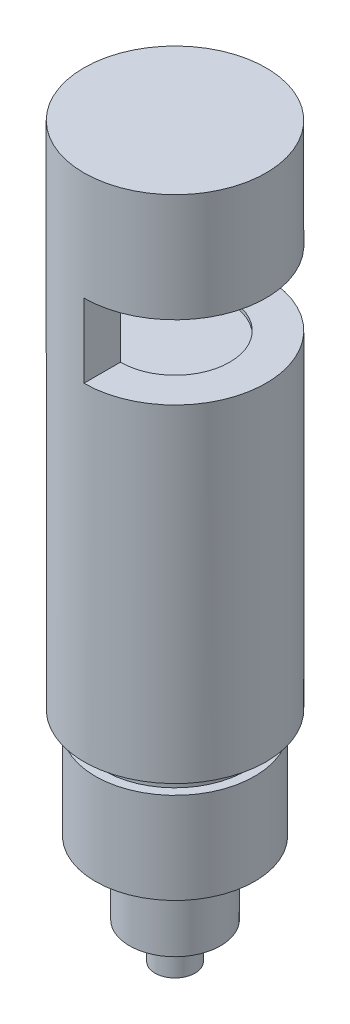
ISO-10303-21;
HEADER;
FILE_DESCRIPTION(('STEP AP214'),'2;1');
FILE_NAME('part.step','',(''),(''),'','','');
FILE_SCHEMA(('AUTOMOTIVE_DESIGN { 1 0 10303 214 1 1 1 1 }'));
ENDSEC;
DATA;
#1=APPLICATION_CONTEXT('core data for automotive mechanical design processes');
#2=APPLICATION_PROTOCOL_DEFINITION('international standard','automotive_design',2000,#1);
#3=PRODUCT_CONTEXT('',#1,'mechanical');
#4=PRODUCT('Part','Part','',(#3));
#5=PRODUCT_RELATED_PRODUCT_CATEGORY('part','',(#4));
#6=PRODUCT_DEFINITION_FORMATION('','',#4);
#7=PRODUCT_DEFINITION_CONTEXT('part definition',#1,'design');
#8=PRODUCT_DEFINITION('design','',#6,#7);
#9=PRODUCT_DEFINITION_SHAPE('','',#8);
#10=(LENGTH_UNIT() NAMED_UNIT(*) SI_UNIT(.MILLI.,.METRE.));
#11=(NAMED_UNIT(*) PLANE_ANGLE_UNIT() SI_UNIT($,.RADIAN.));
#12=(NAMED_UNIT(*) SI_UNIT($,.STERADIAN.) SOLID_ANGLE_UNIT());
#13=UNCERTAINTY_MEASURE_WITH_UNIT(LENGTH_MEASURE(1.E-05),#10,'distance_accuracy_value','');
#14=(GEOMETRIC_REPRESENTATION_CONTEXT(3) GLOBAL_UNCERTAINTY_ASSIGNED_CONTEXT((#13)) GLOBAL_UNIT_ASSIGNED_CONTEXT((#10,
#11,#12)) REPRESENTATION_CONTEXT('',''));
#15=CARTESIAN_POINT('',(0.,0.,0.));
#16=DIRECTION('',(0.,0.,1.));
#17=DIRECTION('',(1.,0.,0.));
#18=AXIS2_PLACEMENT_3D('',#15,#16,#17);
#19=CARTESIAN_POINT('',(0.,-12.7,0.));
#20=DIRECTION('',(0.,-1.,0.));
#21=DIRECTION('',(0.,0.,-1.));
#22=AXIS2_PLACEMENT_3D('',#19,#20,#21);
#23=PLANE('',#22);
#24=CARTESIAN_POINT('',(0.,-12.7,0.));
#25=DIRECTION('',(0.,-1.,0.));
#26=DIRECTION('',(0.,0.,-1.));
#27=AXIS2_PLACEMENT_3D('',#24,#25,#26);
#28=CIRCLE('',#27,3.175);
#29=CARTESIAN_POINT('',(0.,-12.7,-3.175));
#30=VERTEX_POINT('',#29);
#31=EDGE_CURVE('E124',#30,#30,#28,.T.);
#32=ORIENTED_EDGE('',*,*,#31,.T.);
#33=EDGE_LOOP('',(#32));
#34=FACE_BOUND('',#33,.T.);
#35=CARTESIAN_POINT('',(0.,-12.7,0.));
#36=DIRECTION('',(0.,-1.,0.));
#37=DIRECTION('',(1.,0.,0.));
#38=AXIS2_PLACEMENT_3D('',#35,#36,#37);
#39=CIRCLE('',#38,1.397);
#40=CARTESIAN_POINT('',(1.397,-12.7,0.));
#41=VERTEX_POINT('',#40);
#42=EDGE_CURVE('E143',#41,#41,#39,.T.);
#43=ORIENTED_EDGE('',*,*,#42,.F.);
#44=EDGE_LOOP('',(#43));
#45=FACE_BOUND('',#44,.T.);
#46=ADVANCED_FACE('F37',(#34,#45),#23,.T.);
#47=CARTESIAN_POINT('',(0.,28.0035,-17.78));
#48=DIRECTION('',(-1.,0.,0.));
#49=DIRECTION('',(0.,-1.,0.));
#50=AXIS2_PLACEMENT_3D('',#47,#48,#49);
#51=PLANE('',#50);
#52=DIRECTION('',(0.,-1.,0.));
#53=VECTOR('',#52,1.);
#54=CARTESIAN_POINT('',(0.,39.287807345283,-3.81));
#55=LINE('',#54,#53);
#56=CARTESIAN_POINT('',(0.,22.86,-3.81));
#57=VERTEX_POINT('',#56);
#58=CARTESIAN_POINT('',(0.,28.0035,-3.81));
#59=VERTEX_POINT('',#58);
#60=EDGE_CURVE('E77',#57,#59,#55,.F.);
#61=ORIENTED_EDGE('',*,*,#60,.F.);
#62=DIRECTION('',(0.,0.,1.));
#63=VECTOR('',#62,1.);
#64=CARTESIAN_POINT('',(0.,22.86,-17.78));
#65=LINE('',#64,#63);
#66=CARTESIAN_POINT('',(0.,22.86,-6.35));
#67=VERTEX_POINT('',#66);
#68=EDGE_CURVE('E86',#67,#57,#65,.T.);
#69=ORIENTED_EDGE('',*,*,#68,.F.);
#70=DIRECTION('',(0.,-1.,0.));
#71=VECTOR('',#70,1.);
#72=CARTESIAN_POINT('',(0.,35.56,-6.35));
#73=LINE('',#72,#71);
#74=CARTESIAN_POINT('',(0.,28.0035,-6.35));
#75=VERTEX_POINT('',#74);
#76=EDGE_CURVE('E107',#75,#67,#73,.T.);
#77=ORIENTED_EDGE('',*,*,#76,.F.);
#78=DIRECTION('',(0.,0.,1.));
#79=VECTOR('',#78,1.);
#80=CARTESIAN_POINT('',(0.,28.0035,-17.78));
#81=LINE('',#80,#79);
#82=EDGE_CURVE('E89',#75,#59,#81,.T.);
#83=ORIENTED_EDGE('',*,*,#82,.T.);
#84=EDGE_LOOP('',(#61,#69,#77,#83));
#85=FACE_BOUND('',#84,.T.);
#86=ADVANCED_FACE('F85',(#85),#51,.F.);
#87=DIRECTION('',(0.,-1.,0.));
#88=VECTOR('',#87,1.);
#89=CARTESIAN_POINT('',(0.,39.287807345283,3.81));
#90=LINE('',#89,#88);
#91=CARTESIAN_POINT('',(0.,28.0035,3.81));
#92=VERTEX_POINT('',#91);
#93=CARTESIAN_POINT('',(0.,22.86,3.81));
#94=VERTEX_POINT('',#93);
#95=EDGE_CURVE('E51',#92,#94,#90,.T.);
#96=ORIENTED_EDGE('',*,*,#95,.F.);
#97=CARTESIAN_POINT('',(0.,28.0035,6.35));
#98=VERTEX_POINT('',#97);
#99=EDGE_CURVE('E58',#92,#98,#81,.T.);
#100=ORIENTED_EDGE('',*,*,#99,.T.);
#101=DIRECTION('',(0.,-1.,0.));
#102=VECTOR('',#101,1.);
#103=CARTESIAN_POINT('',(0.,35.56,6.35));
#104=LINE('',#103,#102);
#105=CARTESIAN_POINT('',(0.,22.86,6.35));
#106=VERTEX_POINT('',#105);
#107=EDGE_CURVE('E104',#106,#98,#104,.F.);
#108=ORIENTED_EDGE('',*,*,#107,.F.);
#109=EDGE_CURVE('E95',#94,#106,#65,.T.);
#110=ORIENTED_EDGE('',*,*,#109,.F.);
#111=EDGE_LOOP('',(#96,#100,#108,#110));
#112=FACE_BOUND('',#111,.T.);
#113=ADVANCED_FACE('F164',(#112),#51,.F.);
#114=CARTESIAN_POINT('',(6.35,28.0035,-17.78));
#115=DIRECTION('',(0.,1.,0.));
#116=DIRECTION('',(0.,0.,1.));
#117=AXIS2_PLACEMENT_3D('',#114,#115,#116);
#118=PLANE('',#117);
#119=CARTESIAN_POINT('',(0.,28.0035,0.));
#120=DIRECTION('',(0.,1.,0.));
#121=DIRECTION('',(0.,0.,1.));
#122=AXIS2_PLACEMENT_3D('',#119,#120,#121);
#123=CIRCLE('',#122,3.81);
#124=EDGE_CURVE('E90',#59,#92,#123,.F.);
#125=ORIENTED_EDGE('',*,*,#124,.F.);
#126=ORIENTED_EDGE('',*,*,#82,.F.);
#127=CARTESIAN_POINT('',(0.,28.0035,0.));
#128=DIRECTION('',(0.,1.,0.));
#129=DIRECTION('',(0.,0.,1.));
#130=AXIS2_PLACEMENT_3D('',#127,#128,#129);
#131=CIRCLE('',#130,6.35);
#132=EDGE_CURVE('E45',#98,#75,#131,.T.);
#133=ORIENTED_EDGE('',*,*,#132,.F.);
#134=ORIENTED_EDGE('',*,*,#99,.F.);
#135=EDGE_LOOP('',(#125,#126,#133,#134));
#136=FACE_BOUND('',#135,.T.);
#137=ADVANCED_FACE('F112',(#136),#118,.F.);
#138=CARTESIAN_POINT('',(6.35,22.86,-17.78));
#139=DIRECTION('',(0.,-1.,0.));
#140=DIRECTION('',(1.,0.,0.));
#141=AXIS2_PLACEMENT_3D('',#138,#139,#140);
#142=PLANE('',#141);
#143=CARTESIAN_POINT('',(0.,22.86,0.));
#144=DIRECTION('',(0.,-1.,0.));
#145=DIRECTION('',(1.,0.,0.));
#146=AXIS2_PLACEMENT_3D('',#143,#144,#145);
#147=CIRCLE('',#146,3.81);
#148=EDGE_CURVE('E12',#94,#57,#147,.F.);
#149=ORIENTED_EDGE('',*,*,#148,.F.);
#150=ORIENTED_EDGE('',*,*,#109,.T.);
#151=CARTESIAN_POINT('',(0.,22.86,0.));
#152=DIRECTION('',(0.,-1.,0.));
#153=DIRECTION('',(1.,0.,0.));
#154=AXIS2_PLACEMENT_3D('',#151,#152,#153);
#155=CIRCLE('',#154,6.35);
#156=EDGE_CURVE('E94',#67,#106,#155,.T.);
#157=ORIENTED_EDGE('',*,*,#156,.F.);
#158=ORIENTED_EDGE('',*,*,#68,.T.);
#159=EDGE_LOOP('',(#149,#150,#157,#158));
#160=FACE_BOUND('',#159,.T.);
#161=ADVANCED_FACE('F92',(#160),#142,.F.);
#162=CARTESIAN_POINT('',(0.,35.56,0.));
#163=DIRECTION('',(0.,-1.,0.));
#164=DIRECTION('',(0.,0.,-1.));
#165=AXIS2_PLACEMENT_3D('',#162,#163,#164);
#166=CYLINDRICAL_SURFACE('',#165,6.35);
#167=ORIENTED_EDGE('',*,*,#107,.T.);
#168=ORIENTED_EDGE('',*,*,#132,.T.);
#169=ORIENTED_EDGE('',*,*,#76,.T.);
#170=ORIENTED_EDGE('',*,*,#156,.T.);
#171=EDGE_LOOP('',(#167,#168,#169,#170));
#172=FACE_BOUND('',#171,.T.);
#173=CARTESIAN_POINT('',(0.,35.56,0.));
#174=DIRECTION('',(0.,1.,0.));
#175=DIRECTION('',(0.,0.,1.));
#176=AXIS2_PLACEMENT_3D('',#173,#174,#175);
#177=CIRCLE('',#176,6.35);
#178=CARTESIAN_POINT('',(0.,35.56,6.35));
#179=VERTEX_POINT('',#178);
#180=EDGE_CURVE('E100',#179,#179,#177,.T.);
#181=ORIENTED_EDGE('',*,*,#180,.F.);
#182=EDGE_LOOP('',(#181));
#183=FACE_BOUND('',#182,.T.);
#184=CARTESIAN_POINT('',(0.,0.,0.));
#185=DIRECTION('',(0.,1.,0.));
#186=DIRECTION('',(-1.,0.,0.));
#187=AXIS2_PLACEMENT_3D('',#184,#185,#186);
#188=CIRCLE('',#187,6.35000000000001);
#189=CARTESIAN_POINT('',(-6.35000000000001,0.,0.));
#190=VERTEX_POINT('',#189);
#191=EDGE_CURVE('E128',#190,#190,#188,.T.);
#192=ORIENTED_EDGE('',*,*,#191,.T.);
#193=EDGE_LOOP('',(#192));
#194=FACE_BOUND('',#193,.T.);
#195=ADVANCED_FACE('F39',(#172,#183,#194),#166,.T.);
#196=CARTESIAN_POINT('',(0.,35.56,0.));
#197=DIRECTION('',(0.,1.,0.));
#198=DIRECTION('',(0.,0.,1.));
#199=AXIS2_PLACEMENT_3D('',#196,#197,#198);
#200=PLANE('',#199);
#201=ORIENTED_EDGE('',*,*,#180,.T.);
#202=EDGE_LOOP('',(#201));
#203=FACE_BOUND('',#202,.T.);
#204=ADVANCED_FACE('F189',(#203),#200,.T.);
#205=CARTESIAN_POINT('',(0.,39.287807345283,0.));
#206=DIRECTION('',(0.,-1.,0.));
#207=DIRECTION('',(1.,0.,0.));
#208=AXIS2_PLACEMENT_3D('',#205,#206,#207);
#209=CYLINDRICAL_SURFACE('',#208,3.81);
#210=CARTESIAN_POINT('',(0.,22.606,0.));
#211=DIRECTION('',(0.,1.,0.));
#212=DIRECTION('',(-1.,0.,0.));
#213=AXIS2_PLACEMENT_3D('',#210,#211,#212);
#214=CIRCLE('',#213,3.81);
#215=CARTESIAN_POINT('',(-3.81000000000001,22.606,0.));
#216=VERTEX_POINT('',#215);
#217=EDGE_CURVE('E118',#216,#216,#214,.T.);
#218=ORIENTED_EDGE('',*,*,#217,.F.);
#219=EDGE_LOOP('',(#218));
#220=FACE_BOUND('',#219,.T.);
#221=CARTESIAN_POINT('',(0.,28.2575,0.));
#222=DIRECTION('',(0.,1.,0.));
#223=DIRECTION('',(0.,0.,1.));
#224=AXIS2_PLACEMENT_3D('',#221,#222,#223);
#225=CIRCLE('',#224,3.81);
#226=CARTESIAN_POINT('',(0.,28.2575,3.81));
#227=VERTEX_POINT('',#226);
#228=EDGE_CURVE('E115',#227,#227,#225,.T.);
#229=ORIENTED_EDGE('',*,*,#228,.T.);
#230=EDGE_LOOP('',(#229));
#231=FACE_BOUND('',#230,.T.);
#232=ORIENTED_EDGE('',*,*,#124,.T.);
#233=ORIENTED_EDGE('',*,*,#95,.T.);
#234=ORIENTED_EDGE('',*,*,#148,.T.);
#235=ORIENTED_EDGE('',*,*,#60,.T.);
#236=EDGE_LOOP('',(#232,#233,#234,#235));
#237=FACE_BOUND('',#236,.T.);
#238=ADVANCED_FACE('F76',(#220,#231,#237),#209,.F.);
#239=CARTESIAN_POINT('',(6.35,28.2575,-17.78));
#240=DIRECTION('',(0.,1.,0.));
#241=DIRECTION('',(0.,0.,1.));
#242=AXIS2_PLACEMENT_3D('',#239,#240,#241);
#243=PLANE('',#242);
#244=ORIENTED_EDGE('',*,*,#228,.F.);
#245=EDGE_LOOP('',(#244));
#246=FACE_BOUND('',#245,.T.);
#247=ADVANCED_FACE('F185',(#246),#243,.F.);
#248=CARTESIAN_POINT('',(0.,22.606,0.));
#249=DIRECTION('',(0.,1.,0.));
#250=DIRECTION('',(-1.,0.,0.));
#251=AXIS2_PLACEMENT_3D('',#248,#249,#250);
#252=PLANE('',#251);
#253=ORIENTED_EDGE('',*,*,#217,.T.);
#254=EDGE_LOOP('',(#253));
#255=FACE_BOUND('',#254,.T.);
#256=ADVANCED_FACE('F182',(#255),#252,.T.);
#257=CARTESIAN_POINT('',(0.,1.4351,0.));
#258=DIRECTION('',(0.,-1.,0.));
#259=DIRECTION('',(1.,0.,0.));
#260=AXIS2_PLACEMENT_3D('',#257,#258,#259);
#261=CONICAL_SURFACE('',#260,4.9149,0.785398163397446);
#262=ORIENTED_EDGE('',*,*,#191,.F.);
#263=EDGE_LOOP('',(#262));
#264=FACE_BOUND('',#263,.T.);
#265=CARTESIAN_POINT('',(0.,1.4351,0.));
#266=DIRECTION('',(0.,1.,0.));
#267=DIRECTION('',(-1.,0.,0.));
#268=AXIS2_PLACEMENT_3D('',#265,#266,#267);
#269=CIRCLE('',#268,4.9149);
#270=CARTESIAN_POINT('',(-4.9149,1.43510000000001,0.));
#271=VERTEX_POINT('',#270);
#272=EDGE_CURVE('E133',#271,#271,#269,.T.);
#273=ORIENTED_EDGE('',*,*,#272,.T.);
#274=EDGE_LOOP('',(#273));
#275=FACE_BOUND('',#274,.T.);
#276=ADVANCED_FACE('F168',(#264,#275),#261,.F.);
#277=CARTESIAN_POINT('',(0.,0.,0.));
#278=DIRECTION('',(0.,1.,0.));
#279=DIRECTION('',(-1.,0.,0.));
#280=AXIS2_PLACEMENT_3D('',#277,#278,#279);
#281=CYLINDRICAL_SURFACE('',#280,4.9149);
#282=ORIENTED_EDGE('',*,*,#272,.F.);
#283=EDGE_LOOP('',(#282));
#284=FACE_BOUND('',#283,.T.);
#285=CARTESIAN_POINT('',(0.,-1.27000000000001,0.));
#286=DIRECTION('',(0.,1.,0.));
#287=DIRECTION('',(-1.,0.,0.));
#288=AXIS2_PLACEMENT_3D('',#285,#286,#287);
#289=CIRCLE('',#288,4.9149);
#290=CARTESIAN_POINT('',(-4.9149,-1.27,0.));
#291=VERTEX_POINT('',#290);
#292=EDGE_CURVE('E136',#291,#291,#289,.T.);
#293=ORIENTED_EDGE('',*,*,#292,.T.);
#294=EDGE_LOOP('',(#293));
#295=FACE_BOUND('',#294,.T.);
#296=ADVANCED_FACE('F208',(#284,#295),#281,.T.);
#297=CARTESIAN_POINT('',(-4.9149,-1.27,0.));
#298=DIRECTION('',(0.,-1.,0.));
#299=DIRECTION('',(1.,0.,0.));
#300=AXIS2_PLACEMENT_3D('',#297,#298,#299);
#301=PLANE('',#300);
#302=ORIENTED_EDGE('',*,*,#292,.F.);
#303=EDGE_LOOP('',(#302));
#304=FACE_BOUND('',#303,.T.);
#305=CARTESIAN_POINT('',(0.,-1.27000000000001,0.));
#306=DIRECTION('',(0.,1.,0.));
#307=DIRECTION('',(-1.,0.,0.));
#308=AXIS2_PLACEMENT_3D('',#305,#306,#307);
#309=CIRCLE('',#308,5.55625);
#310=CARTESIAN_POINT('',(0.,-1.27000000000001,5.55625));
#311=VERTEX_POINT('',#310);
#312=EDGE_CURVE('E139',#311,#311,#309,.T.);
#313=ORIENTED_EDGE('',*,*,#312,.T.);
#314=EDGE_LOOP('',(#313));
#315=FACE_BOUND('',#314,.T.);
#316=ADVANCED_FACE('F174',(#304,#315),#301,.F.);
#317=CARTESIAN_POINT('',(0.,-12.7,0.));
#318=DIRECTION('',(0.,1.,0.));
#319=DIRECTION('',(0.,0.,1.));
#320=AXIS2_PLACEMENT_3D('',#317,#318,#319);
#321=CYLINDRICAL_SURFACE('',#320,3.175);
#322=ORIENTED_EDGE('',*,*,#31,.F.);
#323=EDGE_LOOP('',(#322));
#324=FACE_BOUND('',#323,.T.);
#325=CARTESIAN_POINT('',(0.,-7.62,0.));
#326=DIRECTION('',(0.,-1.,0.));
#327=DIRECTION('',(0.,0.,-1.));
#328=AXIS2_PLACEMENT_3D('',#325,#326,#327);
#329=CIRCLE('',#328,3.175);
#330=CARTESIAN_POINT('',(0.,-7.62,-3.175));
#331=VERTEX_POINT('',#330);
#332=EDGE_CURVE('E125',#331,#331,#329,.T.);
#333=ORIENTED_EDGE('',*,*,#332,.T.);
#334=EDGE_LOOP('',(#333));
#335=FACE_BOUND('',#334,.T.);
#336=ADVANCED_FACE('F170',(#324,#335),#321,.T.);
#337=CARTESIAN_POINT('',(0.,-7.62,0.));
#338=DIRECTION('',(0.,-1.,0.));
#339=DIRECTION('',(0.,0.,-1.));
#340=AXIS2_PLACEMENT_3D('',#337,#338,#339);
#341=PLANE('',#340);
#342=CARTESIAN_POINT('',(0.,-7.62,0.));
#343=DIRECTION('',(0.,-1.,0.));
#344=DIRECTION('',(0.,0.,-1.));
#345=AXIS2_PLACEMENT_3D('',#342,#343,#344);
#346=CIRCLE('',#345,5.55625);
#347=CARTESIAN_POINT('',(0.,-7.62,5.55625));
#348=VERTEX_POINT('',#347);
#349=EDGE_CURVE('E121',#348,#348,#346,.T.);
#350=ORIENTED_EDGE('',*,*,#349,.T.);
#351=EDGE_LOOP('',(#350));
#352=FACE_BOUND('',#351,.T.);
#353=ORIENTED_EDGE('',*,*,#332,.F.);
#354=EDGE_LOOP('',(#353));
#355=FACE_BOUND('',#354,.T.);
#356=ADVANCED_FACE('F173',(#352,#355),#341,.T.);
#357=CARTESIAN_POINT('',(0.,-7.62,0.));
#358=DIRECTION('',(0.,1.,0.));
#359=DIRECTION('',(0.,0.,1.));
#360=AXIS2_PLACEMENT_3D('',#357,#358,#359);
#361=CYLINDRICAL_SURFACE('',#360,5.55625);
#362=CARTESIAN_POINT('',(0.,-1.27000000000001,5.55625));
#363=CARTESIAN_POINT('',(0.,-1.33614583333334,5.55625));
#364=CARTESIAN_POINT('',(0.,-1.40229166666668,5.55625));
#365=CARTESIAN_POINT('',(0.,-1.53458333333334,5.55625));
#366=CARTESIAN_POINT('',(0.,-1.60072916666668,5.55625));
#367=CARTESIAN_POINT('',(0.,-1.73302083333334,5.55625));
#368=CARTESIAN_POINT('',(0.,-1.79916666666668,5.55625));
#369=CARTESIAN_POINT('',(0.,-1.93145833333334,5.55625));
#370=CARTESIAN_POINT('',(0.,-1.99760416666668,5.55625));
#371=CARTESIAN_POINT('',(0.,-2.12989583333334,5.55625));
#372=CARTESIAN_POINT('',(0.,-2.19604166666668,5.55625));
#373=CARTESIAN_POINT('',(0.,-2.32833333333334,5.55625));
#374=CARTESIAN_POINT('',(0.,-2.39447916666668,5.55625));
#375=CARTESIAN_POINT('',(0.,-2.52677083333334,5.55625));
#376=CARTESIAN_POINT('',(0.,-2.59291666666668,5.55625));
#377=CARTESIAN_POINT('',(0.,-2.72520833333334,5.55625));
#378=CARTESIAN_POINT('',(0.,-2.79135416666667,5.55625));
#379=CARTESIAN_POINT('',(0.,-2.92364583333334,5.55625));
#380=CARTESIAN_POINT('',(0.,-2.98979166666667,5.55625));
#381=CARTESIAN_POINT('',(0.,-3.12208333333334,5.55625));
#382=CARTESIAN_POINT('',(0.,-3.18822916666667,5.55625));
#383=CARTESIAN_POINT('',(0.,-3.32052083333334,5.55625));
#384=CARTESIAN_POINT('',(0.,-3.38666666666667,5.55625));
#385=CARTESIAN_POINT('',(0.,-3.51895833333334,5.55625));
#386=CARTESIAN_POINT('',(0.,-3.58510416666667,5.55625));
#387=CARTESIAN_POINT('',(0.,-3.71739583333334,5.55625));
#388=CARTESIAN_POINT('',(0.,-3.78354166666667,5.55625));
#389=CARTESIAN_POINT('',(0.,-3.91583333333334,5.55625));
#390=CARTESIAN_POINT('',(0.,-3.98197916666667,5.55625));
#391=CARTESIAN_POINT('',(0.,-4.11427083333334,5.55625));
#392=CARTESIAN_POINT('',(0.,-4.18041666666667,5.55625));
#393=CARTESIAN_POINT('',(0.,-4.31270833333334,5.55625));
#394=CARTESIAN_POINT('',(0.,-4.37885416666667,5.55625));
#395=CARTESIAN_POINT('',(0.,-4.51114583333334,5.55625));
#396=CARTESIAN_POINT('',(0.,-4.57729166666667,5.55625));
#397=CARTESIAN_POINT('',(0.,-4.70958333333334,5.55625));
#398=CARTESIAN_POINT('',(0.,-4.77572916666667,5.55625));
#399=CARTESIAN_POINT('',(0.,-4.90802083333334,5.55625));
#400=CARTESIAN_POINT('',(0.,-4.97416666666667,5.55625));
#401=CARTESIAN_POINT('',(0.,-5.10645833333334,5.55625));
#402=CARTESIAN_POINT('',(0.,-5.17260416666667,5.55625));
#403=CARTESIAN_POINT('',(0.,-5.30489583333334,5.55625));
#404=CARTESIAN_POINT('',(0.,-5.37104166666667,5.55625));
#405=CARTESIAN_POINT('',(0.,-5.50333333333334,5.55625));
#406=CARTESIAN_POINT('',(0.,-5.56947916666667,5.55625));
#407=CARTESIAN_POINT('',(0.,-5.70177083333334,5.55625));
#408=CARTESIAN_POINT('',(0.,-5.76791666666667,5.55625));
#409=CARTESIAN_POINT('',(0.,-5.90020833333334,5.55625));
#410=CARTESIAN_POINT('',(0.,-5.96635416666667,5.55625));
#411=CARTESIAN_POINT('',(0.,-6.09864583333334,5.55625));
#412=CARTESIAN_POINT('',(0.,-6.16479166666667,5.55625));
#413=CARTESIAN_POINT('',(0.,-6.29708333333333,5.55625));
#414=CARTESIAN_POINT('',(0.,-6.36322916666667,5.55625));
#415=CARTESIAN_POINT('',(0.,-6.49552083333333,5.55625));
#416=CARTESIAN_POINT('',(0.,-6.56166666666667,5.55625));
#417=CARTESIAN_POINT('',(0.,-6.69395833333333,5.55625));
#418=CARTESIAN_POINT('',(0.,-6.76010416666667,5.55625));
#419=CARTESIAN_POINT('',(0.,-6.89239583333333,5.55625));
#420=CARTESIAN_POINT('',(0.,-6.95854166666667,5.55625));
#421=CARTESIAN_POINT('',(0.,-7.09083333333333,5.55625));
#422=CARTESIAN_POINT('',(0.,-7.15697916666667,5.55625));
#423=CARTESIAN_POINT('',(0.,-7.28927083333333,5.55625));
#424=CARTESIAN_POINT('',(0.,-7.35541666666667,5.55625));
#425=CARTESIAN_POINT('',(0.,-7.48770833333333,5.55625));
#426=CARTESIAN_POINT('',(0.,-7.55385416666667,5.55625));
#427=CARTESIAN_POINT('',(0.,-7.62,5.55625));
#428=B_SPLINE_CURVE_WITH_KNOTS('',3,(#362,#363,#364,#365,#366,#367,#368,#369,#370,#371,#372,
#373,#374,#375,#376,#377,#378,#379,#380,#381,#382,#383,#384,#385,#386,#387,#388,#389,#390,#391,
#392,#393,#394,#395,#396,#397,#398,#399,#400,#401,#402,#403,#404,#405,#406,#407,#408,#409,#410,
#411,#412,#413,#414,#415,#416,#417,#418,#419,#420,#421,#422,#423,#424,#425,#426,#427),
.UNSPECIFIED.,.F.,.F.,(4,2,2,2,2,2,2,2,2,2,2,2,2,2,2,2,2,2,2,2,2,2,2,2,2,2,2,2,2,2,2,2,4),(0.,
0.1984375,0.396875,0.595312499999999,0.793749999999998,0.992187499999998,1.190625,1.3890625,
1.5875,1.7859375,1.984375,2.1828125,2.38125,2.5796875,2.77812499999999,2.97656249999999,
3.17499999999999,3.37343749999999,3.57187499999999,3.77031249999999,3.96874999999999,
4.16718749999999,4.36562499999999,4.56406249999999,4.76249999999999,4.96093749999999,
5.15937499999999,5.35781249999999,5.55624999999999,5.75468749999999,5.95312499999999,
6.15156249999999,6.34999999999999),.UNSPECIFIED.);
#429=EDGE_CURVE('BSEAM154',#311,#348,#428,.T.);
#430=ORIENTED_EDGE('',*,*,#312,.F.);
#431=ORIENTED_EDGE('',*,*,#349,.F.);
#432=ORIENTED_EDGE('',*,*,#429,.T.);
#433=ORIENTED_EDGE('',*,*,#429,.F.);
#434=EDGE_LOOP('',(#430,#432,#431,#433));
#435=FACE_BOUND('',#434,.T.);
#436=ADVANCED_FACE('F154',(#435),#361,.T.);
#437=CARTESIAN_POINT('',(0.,-15.24,0.));
#438=DIRECTION('',(0.,1.,0.));
#439=DIRECTION('',(-1.,0.,0.));
#440=AXIS2_PLACEMENT_3D('',#437,#438,#439);
#441=CYLINDRICAL_SURFACE('',#440,1.397);
#442=CARTESIAN_POINT('',(0.,-15.24,0.));
#443=DIRECTION('',(0.,-1.,0.));
#444=DIRECTION('',(1.,0.,0.));
#445=AXIS2_PLACEMENT_3D('',#442,#443,#444);
#446=CIRCLE('',#445,1.397);
#447=CARTESIAN_POINT('',(1.397,-15.24,0.));
#448=VERTEX_POINT('',#447);
#449=EDGE_CURVE('E142',#448,#448,#446,.T.);
#450=ORIENTED_EDGE('',*,*,#449,.F.);
#451=EDGE_LOOP('',(#450));
#452=FACE_BOUND('',#451,.T.);
#453=ORIENTED_EDGE('',*,*,#42,.T.);
#454=EDGE_LOOP('',(#453));
#455=FACE_BOUND('',#454,.T.);
#456=ADVANCED_FACE('F151',(#452,#455),#441,.T.);
#457=CARTESIAN_POINT('',(0.,-15.24,0.));
#458=DIRECTION('',(0.,-1.,0.));
#459=DIRECTION('',(1.,0.,0.));
#460=AXIS2_PLACEMENT_3D('',#457,#458,#459);
#461=PLANE('',#460);
#462=ORIENTED_EDGE('',*,*,#449,.T.);
#463=EDGE_LOOP('',(#462));
#464=FACE_BOUND('',#463,.T.);
#465=ADVANCED_FACE('F149',(#464),#461,.T.);
#466=CLOSED_SHELL('',(#46,#86,#113,#137,#161,#195,#204,#238,#247,#256,#276,#296,#316,#336,#356,
#436,#456,#465));
#467=MANIFOLD_SOLID_BREP('B2',#466);
#468=ADVANCED_BREP_SHAPE_REPRESENTATION('',(#18,#467),#14);
#469=SHAPE_DEFINITION_REPRESENTATION(#9,#468);
ENDSEC;
END-ISO-10303-21;
